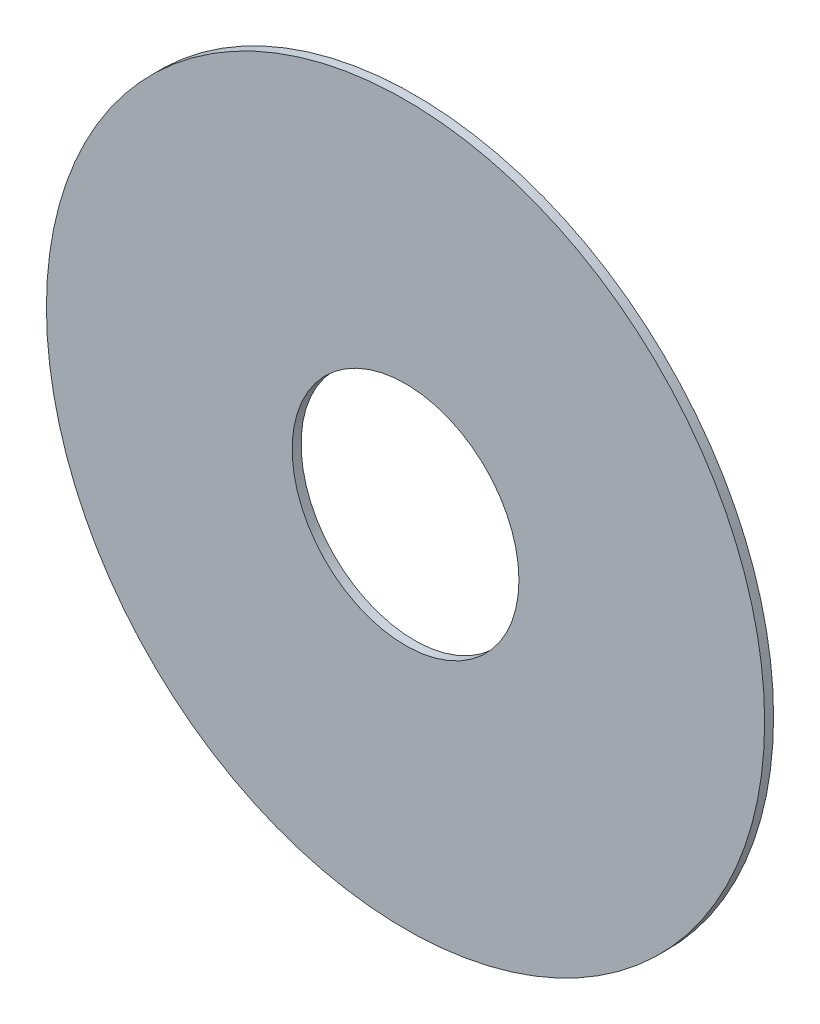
from build123d import *

# Parameters (mm, degrees)
SKETCH1_R           = 12.065
SKETCH1_R_2         = 3.81
BOSS_EXTRUDE1_DEPTH = 0.3


with BuildPart() as part:
    # Sketch1 → Boss-Extrude1 (new body)
    with BuildSketch(Plane.XY):
        Circle(SKETCH1_R)
        Circle(SKETCH1_R_2, mode=Mode.SUBTRACT)
    extrude(amount=BOSS_EXTRUDE1_DEPTH)


solid = part.part
